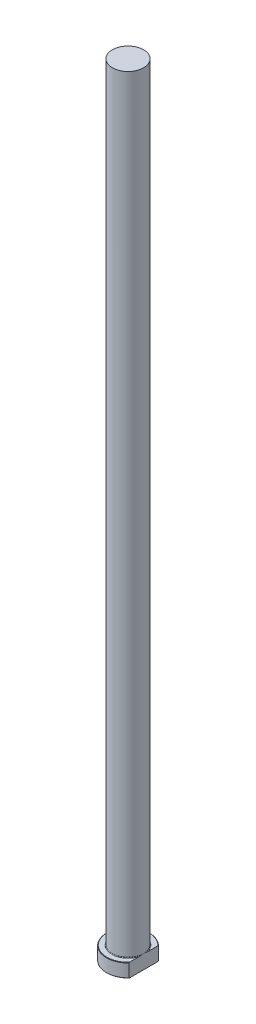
ISO-10303-21;
HEADER;
FILE_DESCRIPTION(('STEP AP214'),'2;1');
FILE_NAME('part.step','',(''),(''),'','','');
FILE_SCHEMA(('AUTOMOTIVE_DESIGN { 1 0 10303 214 1 1 1 1 }'));
ENDSEC;
DATA;
#1=APPLICATION_CONTEXT('core data for automotive mechanical design processes');
#2=APPLICATION_PROTOCOL_DEFINITION('international standard','automotive_design',2000,#1);
#3=PRODUCT_CONTEXT('',#1,'mechanical');
#4=PRODUCT('Part','Part','',(#3));
#5=PRODUCT_RELATED_PRODUCT_CATEGORY('part','',(#4));
#6=PRODUCT_DEFINITION_FORMATION('','',#4);
#7=PRODUCT_DEFINITION_CONTEXT('part definition',#1,'design');
#8=PRODUCT_DEFINITION('design','',#6,#7);
#9=PRODUCT_DEFINITION_SHAPE('','',#8);
#10=(LENGTH_UNIT() NAMED_UNIT(*) SI_UNIT(.MILLI.,.METRE.));
#11=(NAMED_UNIT(*) PLANE_ANGLE_UNIT() SI_UNIT($,.RADIAN.));
#12=(NAMED_UNIT(*) SI_UNIT($,.STERADIAN.) SOLID_ANGLE_UNIT());
#13=UNCERTAINTY_MEASURE_WITH_UNIT(LENGTH_MEASURE(1.E-05),#10,'distance_accuracy_value','');
#14=(GEOMETRIC_REPRESENTATION_CONTEXT(3) GLOBAL_UNCERTAINTY_ASSIGNED_CONTEXT((#13)) GLOBAL_UNIT_ASSIGNED_CONTEXT((#10,
#11,#12)) REPRESENTATION_CONTEXT('',''));
#15=CARTESIAN_POINT('',(0.,0.,0.));
#16=DIRECTION('',(0.,0.,1.));
#17=DIRECTION('',(1.,0.,0.));
#18=AXIS2_PLACEMENT_3D('',#15,#16,#17);
#19=CARTESIAN_POINT('',(0.,0.,0.));
#20=DIRECTION('',(0.,-1.,0.));
#21=DIRECTION('',(0.,0.,-1.));
#22=AXIS2_PLACEMENT_3D('',#19,#20,#21);
#23=PLANE('',#22);
#24=CARTESIAN_POINT('',(0.,0.,0.));
#25=DIRECTION('',(0.,-1.,0.));
#26=DIRECTION('',(0.,0.,-1.));
#27=AXIS2_PLACEMENT_3D('',#24,#25,#26);
#28=CIRCLE('',#27,10.7999999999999);
#29=CARTESIAN_POINT('',(7.99999999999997,0.,7.25534285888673));
#30=VERTEX_POINT('',#29);
#31=CARTESIAN_POINT('',(7.99999999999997,0.,-7.25534285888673));
#32=VERTEX_POINT('',#31);
#33=EDGE_CURVE('E98',#30,#32,#28,.T.);
#34=ORIENTED_EDGE('',*,*,#33,.T.);
#35=DIRECTION('',(0.,0.,1.));
#36=VECTOR('',#35,1.);
#37=CARTESIAN_POINT('',(7.99999999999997,0.,-7.54983443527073));
#38=LINE('',#37,#36);
#39=EDGE_CURVE('E83',#32,#30,#38,.T.);
#40=ORIENTED_EDGE('',*,*,#39,.T.);
#41=EDGE_LOOP('',(#34,#40));
#42=FACE_BOUND('',#41,.T.);
#43=ADVANCED_FACE('F32',(#42),#23,.T.);
#44=CARTESIAN_POINT('',(0.,259.958771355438,0.));
#45=DIRECTION('',(0.,1.,0.));
#46=DIRECTION('',(0.,0.,1.));
#47=AXIS2_PLACEMENT_3D('',#44,#45,#46);
#48=CYLINDRICAL_SURFACE('',#47,11.);
#49=CARTESIAN_POINT('',(0.,6.79999999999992,0.));
#50=DIRECTION('',(0.,1.,0.));
#51=DIRECTION('',(0.,0.,1.));
#52=AXIS2_PLACEMENT_3D('',#49,#50,#51);
#53=CIRCLE('',#52,11.);
#54=CARTESIAN_POINT('',(7.99999999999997,6.79999999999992,7.54983443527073));
#55=VERTEX_POINT('',#54);
#56=CARTESIAN_POINT('',(7.99999999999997,6.79999999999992,-7.54983443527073));
#57=VERTEX_POINT('',#56);
#58=EDGE_CURVE('E104',#55,#57,#53,.F.);
#59=ORIENTED_EDGE('',*,*,#58,.T.);
#60=DIRECTION('',(0.,-1.,0.));
#61=VECTOR('',#60,1.);
#62=CARTESIAN_POINT('',(7.99999999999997,400.,-7.54983443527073));
#63=LINE('',#62,#61);
#64=CARTESIAN_POINT('',(7.99999999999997,0.200000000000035,-7.54983443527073));
#65=VERTEX_POINT('',#64);
#66=EDGE_CURVE('E183',#57,#65,#63,.T.);
#67=ORIENTED_EDGE('',*,*,#66,.T.);
#68=CARTESIAN_POINT('',(0.,0.200000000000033,0.));
#69=DIRECTION('',(0.,-1.,0.));
#70=DIRECTION('',(0.,0.,-1.));
#71=AXIS2_PLACEMENT_3D('',#68,#69,#70);
#72=CIRCLE('',#71,11.);
#73=CARTESIAN_POINT('',(7.99999999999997,0.200000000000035,7.54983443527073));
#74=VERTEX_POINT('',#73);
#75=EDGE_CURVE('E100',#65,#74,#72,.F.);
#76=ORIENTED_EDGE('',*,*,#75,.T.);
#77=DIRECTION('',(0.,-1.,0.));
#78=VECTOR('',#77,1.);
#79=CARTESIAN_POINT('',(7.99999999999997,400.,7.54983443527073));
#80=LINE('',#79,#78);
#81=EDGE_CURVE('E93',#55,#74,#80,.T.);
#82=ORIENTED_EDGE('',*,*,#81,.F.);
#83=EDGE_LOOP('',(#59,#67,#76,#82));
#84=FACE_BOUND('',#83,.T.);
#85=ADVANCED_FACE('F158',(#84),#48,.T.);
#86=CARTESIAN_POINT('',(-11.,7.,0.));
#87=DIRECTION('',(0.,1.,0.));
#88=DIRECTION('',(0.,0.,1.));
#89=AXIS2_PLACEMENT_3D('',#86,#87,#88);
#90=PLANE('',#89);
#91=CARTESIAN_POINT('',(0.,7.,0.));
#92=DIRECTION('',(0.,1.,0.));
#93=DIRECTION('',(0.,0.,1.));
#94=AXIS2_PLACEMENT_3D('',#91,#92,#93);
#95=CIRCLE('',#94,10.7999999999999);
#96=CARTESIAN_POINT('',(7.99999999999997,7.,-7.25534285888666));
#97=VERTEX_POINT('',#96);
#98=CARTESIAN_POINT('',(7.99999999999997,7.,7.25534285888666));
#99=VERTEX_POINT('',#98);
#100=EDGE_CURVE('E178',#97,#99,#95,.T.);
#101=ORIENTED_EDGE('',*,*,#100,.T.);
#102=DIRECTION('',(0.,0.,-1.));
#103=VECTOR('',#102,1.);
#104=CARTESIAN_POINT('',(7.99999999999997,7.,0.));
#105=LINE('',#104,#103);
#106=CARTESIAN_POINT('',(7.99999999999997,6.99999999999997,2.21133443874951));
#107=VERTEX_POINT('',#106);
#108=EDGE_CURVE('E57',#99,#107,#105,.T.);
#109=ORIENTED_EDGE('',*,*,#108,.T.);
#110=CARTESIAN_POINT('',(0.,7.,0.));
#111=DIRECTION('',(0.,1.,0.));
#112=DIRECTION('',(0.,0.,1.));
#113=AXIS2_PLACEMENT_3D('',#110,#111,#112);
#114=CIRCLE('',#113,8.29999999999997);
#115=CARTESIAN_POINT('',(7.99999999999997,6.99999999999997,-2.21133443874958));
#116=VERTEX_POINT('',#115);
#117=EDGE_CURVE('E107',#107,#116,#114,.F.);
#118=ORIENTED_EDGE('',*,*,#117,.T.);
#119=EDGE_CURVE('E136',#116,#97,#105,.T.);
#120=ORIENTED_EDGE('',*,*,#119,.T.);
#121=EDGE_LOOP('',(#101,#109,#118,#120));
#122=FACE_BOUND('',#121,.T.);
#123=ADVANCED_FACE('F147',(#122),#90,.T.);
#124=CARTESIAN_POINT('',(0.,7.00000000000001,0.));
#125=DIRECTION('',(0.,-1.,0.));
#126=DIRECTION('',(0.,0.,-1.));
#127=AXIS2_PLACEMENT_3D('',#124,#125,#126);
#128=CONICAL_SURFACE('',#127,10.7999999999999,0.785398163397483);
#129=ORIENTED_EDGE('',*,*,#58,.F.);
#130=CARTESIAN_POINT('',(7.99999999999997,-0.63673082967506,16.6106304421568));
#131=CARTESIAN_POINT('',(7.99999999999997,-0.418611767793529,16.3685283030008));
#132=CARTESIAN_POINT('',(7.99999999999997,-0.200984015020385,16.125984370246));
#133=CARTESIAN_POINT('',(7.99999999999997,0.233148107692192,15.6398927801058));
#134=CARTESIAN_POINT('',(7.99999999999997,0.449652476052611,15.3963451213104));
#135=CARTESIAN_POINT('',(7.99999999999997,1.09739989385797,14.6638687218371));
#136=CARTESIAN_POINT('',(7.99999999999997,1.52674426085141,14.1732538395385));
#137=CARTESIAN_POINT('',(7.99999999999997,2.16792810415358,13.4304656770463));
#138=CARTESIAN_POINT('',(7.99999999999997,2.38226067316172,13.1804430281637));
#139=CARTESIAN_POINT('',(7.99999999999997,2.80892954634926,12.6787083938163));
#140=CARTESIAN_POINT('',(7.99999999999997,3.02126589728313,12.4269964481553));
#141=CARTESIAN_POINT('',(7.99999999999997,3.44357020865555,11.9216744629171));
#142=CARTESIAN_POINT('',(7.99999999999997,3.65353861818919,11.6680647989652));
#143=CARTESIAN_POINT('',(7.99999999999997,4.07074862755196,11.1585723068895));
#144=CARTESIAN_POINT('',(7.99999999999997,4.27798998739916,10.9026892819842));
#145=CARTESIAN_POINT('',(7.99999999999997,4.66965190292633,10.412760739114));
#146=CARTESIAN_POINT('',(7.99999999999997,4.85436868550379,10.1789522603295));
#147=CARTESIAN_POINT('',(7.99999999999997,5.220635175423,9.70886883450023));
#148=CARTESIAN_POINT('',(7.99999999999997,5.40218492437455,9.47259391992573));
#149=CARTESIAN_POINT('',(7.99999999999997,5.76149237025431,8.99721569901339));
#150=CARTESIAN_POINT('',(7.99999999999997,5.93925050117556,8.75811272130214));
#151=CARTESIAN_POINT('',(7.99999999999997,6.29022306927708,8.27660199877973));
#152=CARTESIAN_POINT('',(7.99999999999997,6.4634376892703,8.03419438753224));
#153=CARTESIAN_POINT('',(7.99999999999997,6.80398487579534,7.5460499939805));
#154=CARTESIAN_POINT('',(7.99999999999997,6.97132935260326,7.30032154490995));
#155=CARTESIAN_POINT('',(7.99999999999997,7.29928849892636,6.80437777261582));
#156=CARTESIAN_POINT('',(7.99999999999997,7.45990280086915,6.55416220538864));
#157=CARTESIAN_POINT('',(7.99999999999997,7.77264940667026,6.04873149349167));
#158=CARTESIAN_POINT('',(7.99999999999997,7.92478824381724,5.79352041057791));
#159=CARTESIAN_POINT('',(7.99999999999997,8.21859570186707,5.27715744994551));
#160=CARTESIAN_POINT('',(7.99999999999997,8.3602661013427,5.01600659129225));
#161=CARTESIAN_POINT('',(7.99999999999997,8.62213596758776,4.50319242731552));
#162=CARTESIAN_POINT('',(7.99999999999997,8.74311989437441,4.25193242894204));
#163=CARTESIAN_POINT('',(7.99999999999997,8.97065709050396,3.74287674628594));
#164=CARTESIAN_POINT('',(7.99999999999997,9.07720941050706,3.48508063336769));
#165=CARTESIAN_POINT('',(7.99999999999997,9.27220860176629,2.96337495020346));
#166=CARTESIAN_POINT('',(7.99999999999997,9.36069936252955,2.69948197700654));
#167=CARTESIAN_POINT('',(7.99999999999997,9.51604316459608,2.16542713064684));
#168=CARTESIAN_POINT('',(7.99999999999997,9.58290677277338,1.89526838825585));
#169=CARTESIAN_POINT('',(7.99999999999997,9.68291221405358,1.39216000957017));
#170=CARTESIAN_POINT('',(7.99999999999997,9.7196747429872,1.15993430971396));
#171=CARTESIAN_POINT('',(7.99999999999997,9.77336730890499,0.693196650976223));
#172=CARTESIAN_POINT('',(7.99999999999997,9.7903003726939,0.458685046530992));
#173=CARTESIAN_POINT('',(7.99999999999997,9.80342851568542,-0.010672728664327));
#174=CARTESIAN_POINT('',(7.99999999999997,9.79964609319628,-0.245518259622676));
#175=CARTESIAN_POINT('',(7.99999999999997,9.77160926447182,-0.71398933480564));
#176=CARTESIAN_POINT('',(7.99999999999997,9.74735189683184,-0.947614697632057));
#177=CARTESIAN_POINT('',(7.99999999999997,9.67070830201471,-1.47287443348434));
#178=CARTESIAN_POINT('',(7.99999999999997,9.61261890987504,-1.7636763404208));
#179=CARTESIAN_POINT('',(7.99999999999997,9.469821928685,-2.33873282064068));
#180=CARTESIAN_POINT('',(7.99999999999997,9.38509750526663,-2.62298313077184));
#181=CARTESIAN_POINT('',(7.99999999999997,9.24134311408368,-3.0443685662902));
#182=CARTESIAN_POINT('',(7.99999999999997,9.19048552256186,-3.18437323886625));
#183=CARTESIAN_POINT('',(7.99999999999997,9.08381674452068,-3.4624156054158));
#184=CARTESIAN_POINT('',(7.99999999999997,9.0280078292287,-3.60045416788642));
#185=CARTESIAN_POINT('',(7.99999999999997,8.91195481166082,-3.8746324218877));
#186=CARTESIAN_POINT('',(7.99999999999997,8.8517110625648,-4.01077226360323));
#187=CARTESIAN_POINT('',(7.99999999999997,8.72725899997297,-4.28124317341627));
#188=CARTESIAN_POINT('',(7.99999999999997,8.66305017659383,-4.41557400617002));
#189=CARTESIAN_POINT('',(7.99999999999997,8.48984738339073,-4.76597692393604));
#190=CARTESIAN_POINT('',(7.99999999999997,8.37796178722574,-4.98062176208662));
#191=CARTESIAN_POINT('',(7.99999999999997,8.14649205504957,-5.40573762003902));
#192=CARTESIAN_POINT('',(7.99999999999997,8.0269065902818,-5.61620791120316));
#193=CARTESIAN_POINT('',(7.99999999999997,7.78128707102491,-6.03349586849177));
#194=CARTESIAN_POINT('',(7.99999999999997,7.65524949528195,-6.24031145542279));
#195=CARTESIAN_POINT('',(7.99999999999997,7.39783636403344,-6.65060320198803));
#196=CARTESIAN_POINT('',(7.99999999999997,7.266460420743,-6.85407911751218));
#197=CARTESIAN_POINT('',(7.99999999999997,6.9989035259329,-7.25856399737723));
#198=CARTESIAN_POINT('',(7.99999999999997,6.86271149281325,-7.45956561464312));
#199=CARTESIAN_POINT('',(7.99999999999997,6.58651908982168,-7.85893907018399));
#200=CARTESIAN_POINT('',(7.99999999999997,6.44651858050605,-8.057310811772));
#201=CARTESIAN_POINT('',(7.99999999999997,6.02178241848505,-8.64881247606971));
#202=CARTESIAN_POINT('',(7.99999999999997,5.73221467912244,-9.03847436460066));
#203=CARTESIAN_POINT('',(7.99999999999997,5.14234581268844,-9.81218500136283));
#204=CARTESIAN_POINT('',(7.99999999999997,4.84200393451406,-10.1962024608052));
#205=CARTESIAN_POINT('',(7.99999999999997,4.2340481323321,-10.9584616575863));
#206=CARTESIAN_POINT('',(7.99999999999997,3.926433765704,-11.3367030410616));
#207=CARTESIAN_POINT('',(7.99999999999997,3.30600745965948,-12.0880358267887));
#208=CARTESIAN_POINT('',(7.99999999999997,2.99320302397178,-12.461133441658));
#209=CARTESIAN_POINT('',(7.99999999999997,2.36317801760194,-13.2035599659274));
#210=CARTESIAN_POINT('',(7.99999999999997,2.04595754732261,-13.5728889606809));
#211=CARTESIAN_POINT('',(7.99999999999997,1.3364401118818,-14.3909378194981));
#212=CARTESIAN_POINT('',(7.99999999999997,0.943258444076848,-14.8388897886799));
#213=CARTESIAN_POINT('',(7.99999999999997,0.351483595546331,-15.5068127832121));
#214=CARTESIAN_POINT('',(7.99999999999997,0.154449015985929,-15.7281687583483));
#215=CARTESIAN_POINT('',(7.99999999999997,-0.240498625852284,-16.1700151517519));
#216=CARTESIAN_POINT('',(7.99999999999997,-0.438411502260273,-16.3905057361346));
#217=CARTESIAN_POINT('',(7.99999999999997,-0.636730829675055,-16.6106304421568));
#218=B_SPLINE_CURVE_WITH_KNOTS('',3,(#130,#131,#132,#133,#134,#135,#136,#137,#138,#139,#140,
#141,#142,#143,#144,#145,#146,#147,#148,#149,#150,#151,#152,#153,#154,#155,#156,#157,#158,#159,
#160,#161,#162,#163,#164,#165,#166,#167,#168,#169,#170,#171,#172,#173,#174,#175,#176,#177,#178,
#179,#180,#181,#182,#183,#184,#185,#186,#187,#188,#189,#190,#191,#192,#193,#194,#195,#196,#197,
#198,#199,#200,#201,#202,#203,#204,#205,#206,#207,#208,#209,#210,#211,#212,#213,#214,#215,#216,
#217),.UNSPECIFIED.,.F.,.F.,(4,2,2,2,2,2,2,2,2,2,2,2,2,2,2,2,2,2,2,2,2,2,2,2,2,2,2,2,2,2,2,2,2,
2,2,2,2,2,2,2,2,2,2,4),(0.,0.977598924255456,1.95519922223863,3.91099512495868,4.89893858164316,
5.88685884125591,6.87458847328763,7.8624044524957,8.75629469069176,9.65017317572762,
10.5439487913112,11.4376883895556,12.3294952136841,13.2213506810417,14.1125088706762,
15.0035153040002,15.8397621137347,16.6760639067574,17.510308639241,18.3441451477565,
19.0487229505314,19.7531931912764,20.4568984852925,21.1607055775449,22.0488428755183,
22.937542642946,23.3843335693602,23.8309205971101,24.2774720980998,24.7240811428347,
25.4500411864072,26.176126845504,26.9026130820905,27.6291521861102,28.3574884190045,
29.0858513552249,30.5420520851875,32.004505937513,33.4670490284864,34.9276355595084,
36.3881889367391,38.1762452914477,39.0652821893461,39.9541391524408),.UNSPECIFIED.);
#219=EDGE_CURVE('E135',#55,#99,#218,.T.);
#220=ORIENTED_EDGE('',*,*,#219,.T.);
#221=ORIENTED_EDGE('',*,*,#100,.F.);
#222=EDGE_CURVE('E127',#97,#57,#218,.T.);
#223=ORIENTED_EDGE('',*,*,#222,.T.);
#224=EDGE_LOOP('',(#129,#220,#221,#223));
#225=FACE_BOUND('',#224,.T.);
#226=ADVANCED_FACE('F143',(#225),#128,.T.);
#227=CARTESIAN_POINT('',(0.,0.200000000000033,0.));
#228=DIRECTION('',(0.,1.,0.));
#229=DIRECTION('',(0.,0.,1.));
#230=AXIS2_PLACEMENT_3D('',#227,#228,#229);
#231=CONICAL_SURFACE('',#230,11.,0.785398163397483);
#232=ORIENTED_EDGE('',*,*,#75,.F.);
#233=CARTESIAN_POINT('',(7.99999999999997,7.63673082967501,-16.6106304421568));
#234=CARTESIAN_POINT('',(7.99999999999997,7.41861176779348,-16.3685283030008));
#235=CARTESIAN_POINT('',(7.99999999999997,7.20098401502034,-16.125984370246));
#236=CARTESIAN_POINT('',(7.99999999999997,6.76685189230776,-15.6398927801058));
#237=CARTESIAN_POINT('',(7.99999999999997,6.55034752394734,-15.3963451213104));
#238=CARTESIAN_POINT('',(7.99999999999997,5.90260010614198,-14.6638687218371));
#239=CARTESIAN_POINT('',(7.99999999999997,5.47325573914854,-14.1732538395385));
#240=CARTESIAN_POINT('',(7.99999999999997,4.83207189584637,-13.4304656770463));
#241=CARTESIAN_POINT('',(7.99999999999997,4.61773932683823,-13.1804430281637));
#242=CARTESIAN_POINT('',(7.99999999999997,4.19107045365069,-12.6787083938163));
#243=CARTESIAN_POINT('',(7.99999999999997,3.97873410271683,-12.4269964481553));
#244=CARTESIAN_POINT('',(7.99999999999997,3.55642979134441,-11.9216744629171));
#245=CARTESIAN_POINT('',(7.99999999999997,3.34646138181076,-11.6680647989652));
#246=CARTESIAN_POINT('',(7.99999999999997,2.92925137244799,-11.1585723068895));
#247=CARTESIAN_POINT('',(7.99999999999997,2.72201001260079,-10.9026892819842));
#248=CARTESIAN_POINT('',(7.99999999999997,2.33034809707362,-10.412760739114));
#249=CARTESIAN_POINT('',(7.99999999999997,2.14563131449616,-10.1789522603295));
#250=CARTESIAN_POINT('',(7.99999999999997,1.77936482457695,-9.70886883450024));
#251=CARTESIAN_POINT('',(7.99999999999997,1.5978150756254,-9.47259391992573));
#252=CARTESIAN_POINT('',(7.99999999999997,1.23850762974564,-8.99721569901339));
#253=CARTESIAN_POINT('',(7.99999999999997,1.06074949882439,-8.75811272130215));
#254=CARTESIAN_POINT('',(7.99999999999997,0.709776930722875,-8.27660199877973));
#255=CARTESIAN_POINT('',(7.99999999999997,0.53656231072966,-8.03419438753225));
#256=CARTESIAN_POINT('',(7.99999999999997,0.196015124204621,-7.5460499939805));
#257=CARTESIAN_POINT('',(7.99999999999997,0.0286706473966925,-7.30032154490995));
#258=CARTESIAN_POINT('',(7.99999999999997,-0.299288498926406,-6.80437777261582));
#259=CARTESIAN_POINT('',(7.99999999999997,-0.459902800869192,-6.55416220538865));
#260=CARTESIAN_POINT('',(7.99999999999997,-0.772649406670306,-6.04873149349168));
#261=CARTESIAN_POINT('',(7.99999999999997,-0.924788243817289,-5.79352041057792));
#262=CARTESIAN_POINT('',(7.99999999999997,-1.21859570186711,-5.27715744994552));
#263=CARTESIAN_POINT('',(7.99999999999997,-1.36026610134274,-5.01600659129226));
#264=CARTESIAN_POINT('',(7.99999999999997,-1.6221359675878,-4.50319242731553));
#265=CARTESIAN_POINT('',(7.99999999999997,-1.74311989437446,-4.25193242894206));
#266=CARTESIAN_POINT('',(7.99999999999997,-1.97065709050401,-3.74287674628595));
#267=CARTESIAN_POINT('',(7.99999999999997,-2.0772094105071,-3.4850806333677));
#268=CARTESIAN_POINT('',(7.99999999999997,-2.27220860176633,-2.96337495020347));
#269=CARTESIAN_POINT('',(7.99999999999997,-2.36069936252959,-2.69948197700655));
#270=CARTESIAN_POINT('',(7.99999999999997,-2.51604316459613,-2.16542713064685));
#271=CARTESIAN_POINT('',(7.99999999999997,-2.58290677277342,-1.89526838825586));
#272=CARTESIAN_POINT('',(7.99999999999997,-2.68291221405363,-1.39216000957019));
#273=CARTESIAN_POINT('',(7.99999999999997,-2.71967474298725,-1.15993430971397));
#274=CARTESIAN_POINT('',(7.99999999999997,-2.77336730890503,-0.693196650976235));
#275=CARTESIAN_POINT('',(7.99999999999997,-2.79030037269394,-0.458685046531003));
#276=CARTESIAN_POINT('',(7.99999999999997,-2.80342851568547,0.0106727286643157));
#277=CARTESIAN_POINT('',(7.99999999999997,-2.79964609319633,0.245518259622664));
#278=CARTESIAN_POINT('',(7.99999999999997,-2.77160926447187,0.713989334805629));
#279=CARTESIAN_POINT('',(7.99999999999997,-2.74735189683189,0.947614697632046));
#280=CARTESIAN_POINT('',(7.99999999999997,-2.67070830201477,1.47287443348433));
#281=CARTESIAN_POINT('',(7.99999999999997,-2.61261890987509,1.76367634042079));
#282=CARTESIAN_POINT('',(7.99999999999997,-2.46982192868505,2.33873282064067));
#283=CARTESIAN_POINT('',(7.99999999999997,-2.38509750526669,2.62298313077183));
#284=CARTESIAN_POINT('',(7.99999999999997,-2.24134311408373,3.04436856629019));
#285=CARTESIAN_POINT('',(7.99999999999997,-2.19048552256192,3.18437323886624));
#286=CARTESIAN_POINT('',(7.99999999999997,-2.08381674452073,3.46241560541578));
#287=CARTESIAN_POINT('',(7.99999999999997,-2.02800782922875,3.6004541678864));
#288=CARTESIAN_POINT('',(7.99999999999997,-1.91195481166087,3.87463242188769));
#289=CARTESIAN_POINT('',(7.99999999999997,-1.85171106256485,4.01077226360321));
#290=CARTESIAN_POINT('',(7.99999999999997,-1.72725899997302,4.28124317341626));
#291=CARTESIAN_POINT('',(7.99999999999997,-1.66305017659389,4.41557400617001));
#292=CARTESIAN_POINT('',(7.99999999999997,-1.48984738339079,4.76597692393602));
#293=CARTESIAN_POINT('',(7.99999999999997,-1.37796178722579,4.9806217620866));
#294=CARTESIAN_POINT('',(7.99999999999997,-1.14649205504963,5.405737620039));
#295=CARTESIAN_POINT('',(7.99999999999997,-1.02690659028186,5.61620791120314));
#296=CARTESIAN_POINT('',(7.99999999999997,-0.781287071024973,6.03349586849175));
#297=CARTESIAN_POINT('',(7.99999999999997,-0.65524949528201,6.24031145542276));
#298=CARTESIAN_POINT('',(7.99999999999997,-0.397836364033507,6.65060320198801));
#299=CARTESIAN_POINT('',(7.99999999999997,-0.266460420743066,6.85407911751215));
#300=CARTESIAN_POINT('',(7.99999999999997,0.00109647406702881,7.2585639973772));
#301=CARTESIAN_POINT('',(7.99999999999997,0.137288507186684,7.45956561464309));
#302=CARTESIAN_POINT('',(7.99999999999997,0.413480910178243,7.85893907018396));
#303=CARTESIAN_POINT('',(7.99999999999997,0.553481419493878,8.05731081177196));
#304=CARTESIAN_POINT('',(7.99999999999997,0.978217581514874,8.64881247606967));
#305=CARTESIAN_POINT('',(7.99999999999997,1.26778532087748,9.03847436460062));
#306=CARTESIAN_POINT('',(7.99999999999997,1.85765418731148,9.81218500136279));
#307=CARTESIAN_POINT('',(7.99999999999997,2.15799606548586,10.1962024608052));
#308=CARTESIAN_POINT('',(7.99999999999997,2.76595186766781,10.9584616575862));
#309=CARTESIAN_POINT('',(7.99999999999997,3.07356623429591,11.3367030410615));
#310=CARTESIAN_POINT('',(7.99999999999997,3.69399254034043,12.0880358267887));
#311=CARTESIAN_POINT('',(7.99999999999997,4.00679697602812,12.461133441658));
#312=CARTESIAN_POINT('',(7.99999999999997,4.63682198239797,13.2035599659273));
#313=CARTESIAN_POINT('',(7.99999999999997,4.95404245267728,13.5728889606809));
#314=CARTESIAN_POINT('',(7.99999999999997,5.66355988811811,14.390937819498));
#315=CARTESIAN_POINT('',(7.99999999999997,6.05674155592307,14.8388897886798));
#316=CARTESIAN_POINT('',(7.99999999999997,6.6485164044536,15.5068127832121));
#317=CARTESIAN_POINT('',(7.99999999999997,6.845550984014,15.7281687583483));
#318=CARTESIAN_POINT('',(7.99999999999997,7.24049862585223,16.1700151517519));
#319=CARTESIAN_POINT('',(7.99999999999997,7.43841150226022,16.3905057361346));
#320=CARTESIAN_POINT('',(7.99999999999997,7.63673082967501,16.6106304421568));
#321=B_SPLINE_CURVE_WITH_KNOTS('',3,(#233,#234,#235,#236,#237,#238,#239,#240,#241,#242,#243,
#244,#245,#246,#247,#248,#249,#250,#251,#252,#253,#254,#255,#256,#257,#258,#259,#260,#261,#262,
#263,#264,#265,#266,#267,#268,#269,#270,#271,#272,#273,#274,#275,#276,#277,#278,#279,#280,#281,
#282,#283,#284,#285,#286,#287,#288,#289,#290,#291,#292,#293,#294,#295,#296,#297,#298,#299,#300,
#301,#302,#303,#304,#305,#306,#307,#308,#309,#310,#311,#312,#313,#314,#315,#316,#317,#318,#319,
#320),.UNSPECIFIED.,.F.,.F.,(4,2,2,2,2,2,2,2,2,2,2,2,2,2,2,2,2,2,2,2,2,2,2,2,2,2,2,2,2,2,2,2,2,
2,2,2,2,2,2,2,2,2,2,4),(0.,0.977598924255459,1.95519922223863,3.91099512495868,4.89893858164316,
5.88685884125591,6.87458847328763,7.8624044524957,8.75629469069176,9.65017317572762,
10.5439487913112,11.4376883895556,12.3294952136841,13.2213506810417,14.1125088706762,
15.0035153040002,15.8397621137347,16.6760639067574,17.510308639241,18.3441451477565,
19.0487229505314,19.7531931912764,20.4568984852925,21.1607055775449,22.0488428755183,
22.937542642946,23.3843335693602,23.83092059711,24.2774720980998,24.7240811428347,
25.4500411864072,26.176126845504,26.9026130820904,27.6291521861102,28.3574884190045,
29.0858513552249,30.5420520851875,32.0045059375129,33.4670490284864,34.9276355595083,
36.388188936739,38.1762452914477,39.0652821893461,39.9541391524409),.UNSPECIFIED.);
#322=EDGE_CURVE('E86',#65,#32,#321,.T.);
#323=ORIENTED_EDGE('',*,*,#322,.T.);
#324=ORIENTED_EDGE('',*,*,#33,.F.);
#325=EDGE_CURVE('E89',#30,#74,#321,.T.);
#326=ORIENTED_EDGE('',*,*,#325,.T.);
#327=EDGE_LOOP('',(#232,#323,#324,#326));
#328=FACE_BOUND('',#327,.T.);
#329=ADVANCED_FACE('F97',(#328),#231,.T.);
#330=CARTESIAN_POINT('',(0.,7.29999999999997,0.));
#331=DIRECTION('',(0.,1.,0.));
#332=DIRECTION('',(0.,0.,1.));
#333=AXIS2_PLACEMENT_3D('',#330,#331,#332);
#334=TOROIDAL_SURFACE('',#333,8.29999999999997,0.3);
#335=CARTESIAN_POINT('',(7.99999999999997,7.29999999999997,0.));
#336=CARTESIAN_POINT('',(7.99999999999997,7.30000062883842,1.41343368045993E-10));
#337=CARTESIAN_POINT('',(7.99999999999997,7.30000125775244,-3.45355322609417E-07));
#338=CARTESIAN_POINT('',(7.99999999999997,7.30000241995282,-1.23398463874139E-06));
#339=CARTESIAN_POINT('',(7.99999999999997,7.30000291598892,-1.80141989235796E-06));
#340=CARTESIAN_POINT('',(7.99999999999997,7.30000399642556,-3.18390842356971E-06));
#341=CARTESIAN_POINT('',(7.99999999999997,7.30000456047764,-4.02115832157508E-06));
#342=CARTESIAN_POINT('',(7.99999999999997,7.30000552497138,-5.71072460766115E-06));
#343=CARTESIAN_POINT('',(7.99999999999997,7.30000593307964,-6.55926444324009E-06));
#344=CARTESIAN_POINT('',(7.99999999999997,7.30000755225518,-1.000964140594E-05));
#345=CARTESIAN_POINT('',(7.99999999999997,7.30000869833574,-1.26477244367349E-05));
#346=CARTESIAN_POINT('',(7.99999999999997,7.30001047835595,-1.77422280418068E-05));
#347=CARTESIAN_POINT('',(7.99999999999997,7.30001115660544,-2.01836505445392E-05));
#348=CARTESIAN_POINT('',(7.99999999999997,7.30001417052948,-3.09435594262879E-05));
#349=CARTESIAN_POINT('',(7.99999999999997,7.30001656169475,-3.92473415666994E-05));
#350=CARTESIAN_POINT('',(7.99999999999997,7.30001991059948,-5.46311733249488E-05));
#351=CARTESIAN_POINT('',(7.99999999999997,7.30002104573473,-6.16717033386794E-05));
#352=CARTESIAN_POINT('',(7.99999999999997,7.30002955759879,-0.000115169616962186));
#353=CARTESIAN_POINT('',(7.99999999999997,7.30003630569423,-0.000161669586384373));
#354=CARTESIAN_POINT('',(7.99999999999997,7.30006581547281,-0.00034712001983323));
#355=CARTESIAN_POINT('',(7.99999999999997,7.30009364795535,-0.000485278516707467));
#356=CARTESIAN_POINT('',(7.99999999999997,7.30020325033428,-0.00103711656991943));
#357=CARTESIAN_POINT('',(7.99999999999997,7.30028197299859,-0.00145117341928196));
#358=CARTESIAN_POINT('',(7.99999999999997,7.30059973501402,-0.00311182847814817));
#359=CARTESIAN_POINT('',(7.99999999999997,7.30084275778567,-0.00435790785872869));
#360=CARTESIAN_POINT('',(7.99999999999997,7.30186073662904,-0.00958966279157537));
#361=CARTESIAN_POINT('',(7.99999999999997,7.30263061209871,-0.0135760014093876));
#362=CARTESIAN_POINT('',(7.99999999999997,7.30870312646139,-0.0450030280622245));
#363=CARTESIAN_POINT('',(7.99999999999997,7.31402334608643,-0.0724414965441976));
#364=CARTESIAN_POINT('',(7.99999999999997,7.32442239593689,-0.126197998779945));
#365=CARTESIAN_POINT('',(7.99999999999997,7.32950218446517,-0.152515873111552));
#366=CARTESIAN_POINT('',(7.99999999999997,7.34609783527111,-0.23868034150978));
#367=CARTESIAN_POINT('',(7.99999999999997,7.35757011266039,-0.29853557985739));
#368=CARTESIAN_POINT('',(7.99999999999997,7.37688511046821,-0.400403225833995));
#369=CARTESIAN_POINT('',(7.99999999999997,7.38478827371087,-0.442404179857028));
#370=CARTESIAN_POINT('',(7.99999999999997,7.40022249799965,-0.525284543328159));
#371=CARTESIAN_POINT('',(7.99999999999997,7.40775782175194,-0.566163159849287));
#372=CARTESIAN_POINT('',(7.99999999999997,7.4322438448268,-0.700743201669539));
#373=CARTESIAN_POINT('',(7.99999999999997,7.44879297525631,-0.794518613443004));
#374=CARTESIAN_POINT('',(7.99999999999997,7.48053424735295,-0.983225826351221));
#375=CARTESIAN_POINT('',(7.99999999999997,7.49571186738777,-1.07816009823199));
#376=CARTESIAN_POINT('',(7.99999999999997,7.52532008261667,-1.27781321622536));
#377=CARTESIAN_POINT('',(7.99999999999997,7.53952614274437,-1.38256589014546));
#378=CARTESIAN_POINT('',(7.99999999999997,7.564310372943,-1.59223320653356));
#379=CARTESIAN_POINT('',(7.99999999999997,7.57489817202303,-1.6971466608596));
#380=CARTESIAN_POINT('',(7.99999999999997,7.58780012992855,-1.86417161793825));
#381=CARTESIAN_POINT('',(7.99999999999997,7.59172630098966,-1.92615747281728));
#382=CARTESIAN_POINT('',(7.99999999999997,7.59748111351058,-2.05022364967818));
#383=CARTESIAN_POINT('',(7.99999999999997,7.59931001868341,-2.11230395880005));
#384=CARTESIAN_POINT('',(7.99999999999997,7.60036180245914,-2.23528941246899));
#385=CARTESIAN_POINT('',(7.99999999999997,7.59963462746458,-2.29619395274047));
#386=CARTESIAN_POINT('',(7.99999999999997,7.59500883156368,-2.41785147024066));
#387=CARTESIAN_POINT('',(7.99999999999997,7.59111224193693,-2.47860451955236));
#388=CARTESIAN_POINT('',(7.99999999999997,7.57906933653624,-2.60042626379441));
#389=CARTESIAN_POINT('',(7.99999999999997,7.570876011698,-2.66149089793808));
#390=CARTESIAN_POINT('',(7.99999999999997,7.55390997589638,-2.7523359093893));
#391=CARTESIAN_POINT('',(7.99999999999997,7.54745990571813,-2.78254437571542));
#392=CARTESIAN_POINT('',(7.99999999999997,7.5325641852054,-2.84244543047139));
#393=CARTESIAN_POINT('',(7.99999999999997,7.52412026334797,-2.87213844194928));
#394=CARTESIAN_POINT('',(7.99999999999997,7.50454333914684,-2.93081083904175));
#395=CARTESIAN_POINT('',(7.99999999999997,7.4933995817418,-2.95978684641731));
#396=CARTESIAN_POINT('',(7.99999999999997,7.47379430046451,-3.00191342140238));
#397=CARTESIAN_POINT('',(7.99999999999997,7.46677809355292,-3.01573193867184));
#398=CARTESIAN_POINT('',(7.99999999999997,7.45153430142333,-3.04267574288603));
#399=CARTESIAN_POINT('',(7.99999999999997,7.44330842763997,-3.05580197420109));
#400=CARTESIAN_POINT('',(7.99999999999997,7.42520334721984,-3.0811225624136));
#401=CARTESIAN_POINT('',(7.99999999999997,7.41530529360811,-3.09330368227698));
#402=CARTESIAN_POINT('',(7.99999999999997,7.39348961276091,-3.11567039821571));
#403=CARTESIAN_POINT('',(7.99999999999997,7.38158911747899,-3.12587146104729));
#404=CARTESIAN_POINT('',(7.99999999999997,7.3626809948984,-3.13802739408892));
#405=CARTESIAN_POINT('',(7.99999999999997,7.35660667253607,-3.14142291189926));
#406=CARTESIAN_POINT('',(7.99999999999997,7.34401523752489,-3.14727797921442));
#407=CARTESIAN_POINT('',(7.99999999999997,7.33749832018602,-3.14973793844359));
#408=CARTESIAN_POINT('',(7.99999999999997,7.32406766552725,-3.15352036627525));
#409=CARTESIAN_POINT('',(7.99999999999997,7.31715078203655,-3.15483196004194));
#410=CARTESIAN_POINT('',(7.99999999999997,7.30319454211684,-3.15612126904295));
#411=CARTESIAN_POINT('',(7.99999999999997,7.29615528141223,-3.15609998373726));
#412=CARTESIAN_POINT('',(7.99999999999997,7.28287791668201,-3.15479583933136));
#413=CARTESIAN_POINT('',(7.99999999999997,7.27662738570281,-3.15363338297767));
#414=CARTESIAN_POINT('',(7.99999999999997,7.26438977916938,-3.15033645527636));
#415=CARTESIAN_POINT('',(7.99999999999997,7.25840290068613,-3.14820126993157));
#416=CARTESIAN_POINT('',(7.99999999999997,7.24428488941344,-3.14202752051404));
#417=CARTESIAN_POINT('',(7.99999999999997,7.2363403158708,-3.13756526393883));
#418=CARTESIAN_POINT('',(7.99999999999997,7.22124755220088,-3.1274544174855));
#419=CARTESIAN_POINT('',(7.99999999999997,7.21410153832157,-3.12180270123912));
#420=CARTESIAN_POINT('',(7.99999999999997,7.19559955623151,-3.10524942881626));
#421=CARTESIAN_POINT('',(7.99999999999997,7.18498382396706,-3.09352989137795));
#422=CARTESIAN_POINT('',(7.99999999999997,7.16550497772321,-3.068745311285));
#423=CARTESIAN_POINT('',(7.99999999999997,7.15664572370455,-3.05567739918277));
#424=CARTESIAN_POINT('',(7.99999999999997,7.13735489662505,-3.02391619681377));
#425=CARTESIAN_POINT('',(7.99999999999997,7.12749252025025,-3.00488123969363));
#426=CARTESIAN_POINT('',(7.99999999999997,7.10958189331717,-2.96596235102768));
#427=CARTESIAN_POINT('',(7.99999999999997,7.10153733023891,-2.9460767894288));
#428=CARTESIAN_POINT('',(7.99999999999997,7.08679055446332,-2.90559744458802));
#429=CARTESIAN_POINT('',(7.99999999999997,7.08010240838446,-2.88499860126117));
#430=CARTESIAN_POINT('',(7.99999999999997,7.06789000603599,-2.84348873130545));
#431=CARTESIAN_POINT('',(7.99999999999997,7.06236453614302,-2.8225780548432));
#432=CARTESIAN_POINT('',(7.99999999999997,7.04913807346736,-2.76752236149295));
#433=CARTESIAN_POINT('',(7.99999999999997,7.04220598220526,-2.73319311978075));
#434=CARTESIAN_POINT('',(7.99999999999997,7.0302605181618,-2.66419726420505));
#435=CARTESIAN_POINT('',(7.99999999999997,7.02524820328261,-2.62953047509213));
#436=CARTESIAN_POINT('',(7.99999999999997,7.0124950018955,-2.52504816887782));
#437=CARTESIAN_POINT('',(7.99999999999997,7.00708017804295,-2.45494936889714));
#438=CARTESIAN_POINT('',(7.99999999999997,7.000733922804,-2.31725135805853));
#439=CARTESIAN_POINT('',(7.99999999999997,6.99964073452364,-2.24965783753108));
#440=CARTESIAN_POINT('',(7.99999999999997,7.00055672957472,-2.11488194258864));
#441=CARTESIAN_POINT('',(7.99999999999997,7.00254831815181,-2.04769941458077));
#442=CARTESIAN_POINT('',(7.99999999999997,7.00911662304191,-1.91019632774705));
#443=CARTESIAN_POINT('',(7.99999999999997,7.01381425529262,-1.83988191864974));
#444=CARTESIAN_POINT('',(7.99999999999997,7.02534418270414,-1.69947139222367));
#445=CARTESIAN_POINT('',(7.99999999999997,7.0321753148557,-1.62937517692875));
#446=CARTESIAN_POINT('',(7.99999999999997,7.04774659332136,-1.48770318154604));
#447=CARTESIAN_POINT('',(7.99999999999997,7.05652844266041,-1.41613205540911));
#448=CARTESIAN_POINT('',(7.99999999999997,7.0755719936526,-1.2729917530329));
#449=CARTESIAN_POINT('',(7.99999999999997,7.08583764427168,-1.20142310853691));
#450=CARTESIAN_POINT('',(7.99999999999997,7.11167035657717,-1.03117663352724));
#451=CARTESIAN_POINT('',(7.99999999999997,7.12776522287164,-0.932579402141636));
#452=CARTESIAN_POINT('',(7.99999999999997,7.16130143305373,-0.736797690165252));
#453=CARTESIAN_POINT('',(7.99999999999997,7.1787249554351,-0.639610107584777));
#454=CARTESIAN_POINT('',(7.99999999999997,7.21241690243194,-0.456833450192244));
#455=CARTESIAN_POINT('',(7.99999999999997,7.22858010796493,-0.37122483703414));
#456=CARTESIAN_POINT('',(7.99999999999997,7.25353789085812,-0.240583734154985));
#457=CARTESIAN_POINT('',(7.99999999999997,7.26219901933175,-0.195525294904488));
#458=CARTESIAN_POINT('',(7.99999999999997,7.27945035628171,-0.106166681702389));
#459=CARTESIAN_POINT('',(7.99999999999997,7.28803936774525,-0.0618662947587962));
#460=CARTESIAN_POINT('',(7.99999999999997,7.29737150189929,-0.0135646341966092));
#461=CARTESIAN_POINT('',(7.99999999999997,7.29814363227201,-0.0095669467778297));
#462=CARTESIAN_POINT('',(7.99999999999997,7.29916212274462,-0.0043326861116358));
#463=CARTESIAN_POINT('',(7.99999999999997,7.29940341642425,-0.003095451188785));
#464=CARTESIAN_POINT('',(7.99999999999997,7.29971907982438,-0.00144576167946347));
#465=CARTESIAN_POINT('',(7.99999999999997,7.29979739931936,-0.00103382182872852));
#466=CARTESIAN_POINT('',(7.99999999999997,7.29990652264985,-0.000484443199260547));
#467=CARTESIAN_POINT('',(7.99999999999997,7.29993429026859,-0.000346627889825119));
#468=CARTESIAN_POINT('',(7.99999999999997,7.2999637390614,-0.000161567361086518));
#469=CARTESIAN_POINT('',(7.99999999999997,7.29997047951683,-0.000115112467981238));
#470=CARTESIAN_POINT('',(7.99999999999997,7.29997897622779,-6.16610384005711E-05));
#471=CARTESIAN_POINT('',(7.99999999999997,7.29998010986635,-5.46227082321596E-05));
#472=CARTESIAN_POINT('',(7.99999999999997,7.299983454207,-3.92436766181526E-05));
#473=CARTESIAN_POINT('',(7.99999999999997,7.2999858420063,-3.09423877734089E-05));
#474=CARTESIAN_POINT('',(7.99999999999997,7.29998885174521,-2.01851368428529E-05));
#475=CARTESIAN_POINT('',(7.99999999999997,7.29998952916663,-1.7743877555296E-05));
#476=CARTESIAN_POINT('',(7.99999999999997,7.29999130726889,-1.26495938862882E-05));
#477=CARTESIAN_POINT('',(7.99999999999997,7.29999245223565,-1.00115437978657E-05));
#478=CARTESIAN_POINT('',(7.99999999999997,7.29999406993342,-6.56108535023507E-06));
#479=CARTESIAN_POINT('',(7.99999999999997,7.29999447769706,-5.71247448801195E-06));
#480=CARTESIAN_POINT('',(7.99999999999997,7.29999544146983,-4.02270412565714E-06));
#481=CARTESIAN_POINT('',(7.99999999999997,7.2999960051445,-3.18531707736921E-06));
#482=CARTESIAN_POINT('',(7.99999999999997,7.29999708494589,-1.80252014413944E-06));
#483=CARTESIAN_POINT('',(7.99999999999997,7.29999758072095,-1.23492752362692E-06));
#484=CARTESIAN_POINT('',(7.99999999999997,7.29999874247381,-3.45879353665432E-07));
#485=CARTESIAN_POINT('',(7.99999999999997,7.29999937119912,-1.41334918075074E-10));
#486=CARTESIAN_POINT('',(7.99999999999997,7.29999999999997,0.));
#487=B_SPLINE_CURVE_WITH_KNOTS('',3,(#335,#336,#337,#338,#339,#340,#341,#342,#343,#344,#345,
#346,#347,#348,#349,#350,#351,#352,#353,#354,#355,#356,#357,#358,#359,#360,#361,#362,#363,#364,
#365,#366,#367,#368,#369,#370,#371,#372,#373,#374,#375,#376,#377,#378,#379,#380,#381,#382,#383,
#384,#385,#386,#387,#388,#389,#390,#391,#392,#393,#394,#395,#396,#397,#398,#399,#400,#401,#402,
#403,#404,#405,#406,#407,#408,#409,#410,#411,#412,#413,#414,#415,#416,#417,#418,#419,#420,#421,
#422,#423,#424,#425,#426,#427,#428,#429,#430,#431,#432,#433,#434,#435,#436,#437,#438,#439,#440,
#441,#442,#443,#444,#445,#446,#447,#448,#449,#450,#451,#452,#453,#454,#455,#456,#457,#458,#459,
#460,#461,#462,#463,#464,#465,#466,#467,#468,#469,#470,#471,#472,#473,#474,#475,#476,#477,#478,
#479,#480,#481,#482,#483,#484,#485,#486),.UNSPECIFIED.,.T.,.F.,(4,2,2,2,2,2,2,2,2,2,2,2,2,2,2,2,
2,2,2,2,2,2,2,2,2,2,2,2,2,2,2,2,2,2,2,2,2,2,2,2,2,2,2,2,2,2,2,2,2,2,2,2,2,2,2,2,2,2,2,2,2,2,2,2,
2,2,2,2,2,2,2,2,2,2,2,4),(0.,1.9430465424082E-06,4.23378863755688E-06,7.23541659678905E-06,
1.00606572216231E-05,1.86645549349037E-05,2.62590397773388E-05,5.21541728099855E-05,
7.352737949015E-05,0.000214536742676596,0.000637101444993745,0.00190178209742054,
0.00571013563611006,0.0178905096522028,0.101737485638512,0.182148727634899,0.364982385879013,
0.493196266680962,0.617898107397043,0.903563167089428,1.19196538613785,1.50905932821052,
1.82530271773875,2.01160528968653,2.19788443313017,2.38054404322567,2.56308667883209,
2.74766944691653,2.84028504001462,2.93282063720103,3.02573110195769,3.07218090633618,
3.11856561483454,3.1655130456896,3.21207753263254,3.23289308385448,3.25369950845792,
3.27470089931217,3.29568654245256,3.31467256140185,3.33367253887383,3.36085270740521,
3.38810522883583,3.43527567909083,3.48254866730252,3.54671214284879,3.61100462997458,
3.67593313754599,3.74079353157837,3.8457803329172,3.95082490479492,4.16152093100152,
4.36425153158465,4.56583006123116,4.77720385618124,4.98846262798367,5.20476776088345,
5.42165954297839,5.72134671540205,6.01755113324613,6.27891230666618,6.41656286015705,
6.55193629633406,6.56415137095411,6.56793269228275,6.5691909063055,6.56961242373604,
6.56975329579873,6.56977466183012,6.5698005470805,6.56980814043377,6.56981674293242,
6.56981956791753,6.56982256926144,6.56982485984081,6.56982680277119),.UNSPECIFIED.);
#488=CARTESIAN_POINT('',(7.99999999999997,7.29999999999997,0.));
#489=VERTEX_POINT('',#488);
#490=EDGE_CURVE('E11',#116,#489,#487,.T.);
#491=ORIENTED_EDGE('',*,*,#490,.F.);
#492=ORIENTED_EDGE('',*,*,#117,.F.);
#493=CARTESIAN_POINT('',(7.99999999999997,7.29999999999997,0.));
#494=CARTESIAN_POINT('',(7.99999999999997,7.29999937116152,-1.41343611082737E-10));
#495=CARTESIAN_POINT('',(7.99999999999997,7.29999874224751,3.45355322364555E-07));
#496=CARTESIAN_POINT('',(7.99999999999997,7.29999758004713,1.23398463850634E-06));
#497=CARTESIAN_POINT('',(7.99999999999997,7.29999708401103,1.80141989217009E-06));
#498=CARTESIAN_POINT('',(7.99999999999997,7.29999600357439,3.18390842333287E-06));
#499=CARTESIAN_POINT('',(7.99999999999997,7.29999543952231,4.0211583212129E-06));
#500=CARTESIAN_POINT('',(7.99999999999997,7.29999447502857,5.71072460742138E-06));
#501=CARTESIAN_POINT('',(7.99999999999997,7.2999940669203,6.55926444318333E-06));
#502=CARTESIAN_POINT('',(7.99999999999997,7.29999244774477,1.00096414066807E-05));
#503=CARTESIAN_POINT('',(7.99999999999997,7.2999913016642,1.26477244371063E-05));
#504=CARTESIAN_POINT('',(7.99999999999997,7.29998952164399,1.77422280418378E-05));
#505=CARTESIAN_POINT('',(7.99999999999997,7.2999888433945,2.01836505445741E-05));
#506=CARTESIAN_POINT('',(7.99999999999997,7.29998582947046,3.09435594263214E-05));
#507=CARTESIAN_POINT('',(7.99999999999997,7.29998343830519,3.92473415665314E-05));
#508=CARTESIAN_POINT('',(7.99999999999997,7.29998008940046,5.46311733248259E-05));
#509=CARTESIAN_POINT('',(7.99999999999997,7.29997895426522,6.16717033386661E-05));
#510=CARTESIAN_POINT('',(7.99999999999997,7.29997044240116,0.000115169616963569));
#511=CARTESIAN_POINT('',(7.99999999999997,7.29996369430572,0.000161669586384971));
#512=CARTESIAN_POINT('',(7.99999999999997,7.29993418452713,0.000347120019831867));
#513=CARTESIAN_POINT('',(7.99999999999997,7.2999063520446,0.000485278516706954));
#514=CARTESIAN_POINT('',(7.99999999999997,7.29979674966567,0.00103711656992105));
#515=CARTESIAN_POINT('',(7.99999999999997,7.29971802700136,0.00145117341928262));
#516=CARTESIAN_POINT('',(7.99999999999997,7.29940026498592,0.00311182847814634));
#517=CARTESIAN_POINT('',(7.99999999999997,7.29915724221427,0.00435790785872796));
#518=CARTESIAN_POINT('',(7.99999999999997,7.29813926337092,0.00958966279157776));
#519=CARTESIAN_POINT('',(7.99999999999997,7.29736938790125,0.0135760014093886));
#520=CARTESIAN_POINT('',(7.99999999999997,7.29129687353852,0.0450030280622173));
#521=CARTESIAN_POINT('',(7.99999999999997,7.28597665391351,0.0724414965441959));
#522=CARTESIAN_POINT('',(7.99999999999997,7.27557760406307,0.126197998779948));
#523=CARTESIAN_POINT('',(7.99999999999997,7.27049781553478,0.152515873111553));
#524=CARTESIAN_POINT('',(7.99999999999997,7.25390216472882,0.238680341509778));
#525=CARTESIAN_POINT('',(7.99999999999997,7.24242988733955,0.29853557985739));
#526=CARTESIAN_POINT('',(7.99999999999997,7.22311488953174,0.400403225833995));
#527=CARTESIAN_POINT('',(7.99999999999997,7.21521172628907,0.442404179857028));
#528=CARTESIAN_POINT('',(7.99999999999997,7.19977750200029,0.525284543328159));
#529=CARTESIAN_POINT('',(7.99999999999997,7.192242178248,0.566163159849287));
#530=CARTESIAN_POINT('',(7.99999999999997,7.16775615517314,0.700743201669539));
#531=CARTESIAN_POINT('',(7.99999999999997,7.15120702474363,0.794518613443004));
#532=CARTESIAN_POINT('',(7.99999999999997,7.119465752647,0.983225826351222));
#533=CARTESIAN_POINT('',(7.99999999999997,7.10428813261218,1.07816009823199));
#534=CARTESIAN_POINT('',(7.99999999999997,7.07467991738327,1.27781321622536));
#535=CARTESIAN_POINT('',(7.99999999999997,7.06047385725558,1.38256589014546));
#536=CARTESIAN_POINT('',(7.99999999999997,7.03568962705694,1.59223320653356));
#537=CARTESIAN_POINT('',(7.99999999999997,7.02510182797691,1.6971466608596));
#538=CARTESIAN_POINT('',(7.99999999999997,7.0121998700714,1.86417161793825));
#539=CARTESIAN_POINT('',(7.99999999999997,7.00827369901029,1.92615747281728));
#540=CARTESIAN_POINT('',(7.99999999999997,7.00251888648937,2.05022364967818));
#541=CARTESIAN_POINT('',(7.99999999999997,7.00068998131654,2.11230395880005));
#542=CARTESIAN_POINT('',(7.99999999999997,6.99963819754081,2.23528941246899));
#543=CARTESIAN_POINT('',(7.99999999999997,7.00036537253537,2.29619395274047));
#544=CARTESIAN_POINT('',(7.99999999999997,7.00499116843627,2.41785147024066));
#545=CARTESIAN_POINT('',(7.99999999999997,7.00888775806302,2.47860451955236));
#546=CARTESIAN_POINT('',(7.99999999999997,7.0209306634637,2.60042626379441));
#547=CARTESIAN_POINT('',(7.99999999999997,7.02912398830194,2.66149089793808));
#548=CARTESIAN_POINT('',(7.99999999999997,7.04609002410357,2.7523359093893));
#549=CARTESIAN_POINT('',(7.99999999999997,7.05254009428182,2.78254437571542));
#550=CARTESIAN_POINT('',(7.99999999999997,7.06743581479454,2.84244543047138));
#551=CARTESIAN_POINT('',(7.99999999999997,7.07587973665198,2.87213844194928));
#552=CARTESIAN_POINT('',(7.99999999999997,7.09545666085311,2.93081083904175));
#553=CARTESIAN_POINT('',(7.99999999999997,7.10660041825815,2.95978684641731));
#554=CARTESIAN_POINT('',(7.99999999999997,7.12620569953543,3.00191342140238));
#555=CARTESIAN_POINT('',(7.99999999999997,7.13322190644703,3.01573193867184));
#556=CARTESIAN_POINT('',(7.99999999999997,7.14846569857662,3.04267574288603));
#557=CARTESIAN_POINT('',(7.99999999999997,7.15669157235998,3.05580197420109));
#558=CARTESIAN_POINT('',(7.99999999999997,7.17479665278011,3.0811225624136));
#559=CARTESIAN_POINT('',(7.99999999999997,7.18469470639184,3.09330368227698));
#560=CARTESIAN_POINT('',(7.99999999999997,7.20651038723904,3.11567039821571));
#561=CARTESIAN_POINT('',(7.99999999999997,7.21841088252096,3.12587146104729));
#562=CARTESIAN_POINT('',(7.99999999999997,7.23731900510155,3.13802739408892));
#563=CARTESIAN_POINT('',(7.99999999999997,7.24339332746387,3.14142291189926));
#564=CARTESIAN_POINT('',(7.99999999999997,7.25598476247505,3.14727797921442));
#565=CARTESIAN_POINT('',(7.99999999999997,7.26250167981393,3.14973793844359));
#566=CARTESIAN_POINT('',(7.99999999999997,7.2759323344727,3.15352036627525));
#567=CARTESIAN_POINT('',(7.99999999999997,7.2828492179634,3.15483196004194));
#568=CARTESIAN_POINT('',(7.99999999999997,7.2968054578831,3.15612126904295));
#569=CARTESIAN_POINT('',(7.99999999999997,7.30384471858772,3.15609998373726));
#570=CARTESIAN_POINT('',(7.99999999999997,7.31712208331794,3.15479583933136));
#571=CARTESIAN_POINT('',(7.99999999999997,7.32337261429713,3.15363338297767));
#572=CARTESIAN_POINT('',(7.99999999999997,7.33561022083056,3.15033645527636));
#573=CARTESIAN_POINT('',(7.99999999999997,7.34159709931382,3.14820126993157));
#574=CARTESIAN_POINT('',(7.99999999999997,7.3557151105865,3.14202752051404));
#575=CARTESIAN_POINT('',(7.99999999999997,7.36365968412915,3.13756526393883));
#576=CARTESIAN_POINT('',(7.99999999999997,7.37875244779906,3.1274544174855));
#577=CARTESIAN_POINT('',(7.99999999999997,7.38589846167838,3.12180270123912));
#578=CARTESIAN_POINT('',(7.99999999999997,7.40440044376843,3.10524942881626));
#579=CARTESIAN_POINT('',(7.99999999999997,7.41501617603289,3.09352989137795));
#580=CARTESIAN_POINT('',(7.99999999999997,7.43449502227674,3.068745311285));
#581=CARTESIAN_POINT('',(7.99999999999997,7.4433542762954,3.05567739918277));
#582=CARTESIAN_POINT('',(7.99999999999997,7.4626451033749,3.02391619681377));
#583=CARTESIAN_POINT('',(7.99999999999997,7.47250747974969,3.00488123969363));
#584=CARTESIAN_POINT('',(7.99999999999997,7.49041810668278,2.96596235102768));
#585=CARTESIAN_POINT('',(7.99999999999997,7.49846266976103,2.9460767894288));
#586=CARTESIAN_POINT('',(7.99999999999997,7.51320944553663,2.90559744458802));
#587=CARTESIAN_POINT('',(7.99999999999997,7.51989759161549,2.88499860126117));
#588=CARTESIAN_POINT('',(7.99999999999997,7.53210999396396,2.84348873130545));
#589=CARTESIAN_POINT('',(7.99999999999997,7.53763546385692,2.8225780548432));
#590=CARTESIAN_POINT('',(7.99999999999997,7.55086192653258,2.76752236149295));
#591=CARTESIAN_POINT('',(7.99999999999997,7.55779401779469,2.73319311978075));
#592=CARTESIAN_POINT('',(7.99999999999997,7.56973948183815,2.66419726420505));
#593=CARTESIAN_POINT('',(7.99999999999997,7.57475179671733,2.62953047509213));
#594=CARTESIAN_POINT('',(7.99999999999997,7.58750499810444,2.52504816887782));
#595=CARTESIAN_POINT('',(7.99999999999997,7.592919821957,2.45494936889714));
#596=CARTESIAN_POINT('',(7.99999999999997,7.59926607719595,2.31725135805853));
#597=CARTESIAN_POINT('',(7.99999999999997,7.60035926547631,2.24965783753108));
#598=CARTESIAN_POINT('',(7.99999999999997,7.59944327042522,2.11488194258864));
#599=CARTESIAN_POINT('',(7.99999999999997,7.59745168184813,2.04769941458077));
#600=CARTESIAN_POINT('',(7.99999999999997,7.59088337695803,1.91019632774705));
#601=CARTESIAN_POINT('',(7.99999999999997,7.58618574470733,1.83988191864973));
#602=CARTESIAN_POINT('',(7.99999999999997,7.5746558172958,1.69947139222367));
#603=CARTESIAN_POINT('',(7.99999999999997,7.56782468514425,1.62937517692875));
#604=CARTESIAN_POINT('',(7.99999999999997,7.55225340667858,1.48770318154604));
#605=CARTESIAN_POINT('',(7.99999999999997,7.54347155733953,1.41613205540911));
#606=CARTESIAN_POINT('',(7.99999999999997,7.52442800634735,1.2729917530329));
#607=CARTESIAN_POINT('',(7.99999999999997,7.51416235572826,1.20142310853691));
#608=CARTESIAN_POINT('',(7.99999999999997,7.48832964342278,1.03117663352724));
#609=CARTESIAN_POINT('',(7.99999999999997,7.47223477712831,0.932579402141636));
#610=CARTESIAN_POINT('',(7.99999999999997,7.43869856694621,0.736797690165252));
#611=CARTESIAN_POINT('',(7.99999999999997,7.42127504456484,0.639610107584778));
#612=CARTESIAN_POINT('',(7.99999999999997,7.387583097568,0.456833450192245));
#613=CARTESIAN_POINT('',(7.99999999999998,7.37141989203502,0.371224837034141));
#614=CARTESIAN_POINT('',(7.99999999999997,7.34646210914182,0.240583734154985));
#615=CARTESIAN_POINT('',(7.99999999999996,7.3378009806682,0.195525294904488));
#616=CARTESIAN_POINT('',(7.99999999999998,7.32054964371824,0.106166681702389));
#617=CARTESIAN_POINT('',(8.00000000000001,7.3119606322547,0.0618662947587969));
#618=CARTESIAN_POINT('',(7.99999999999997,7.30262849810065,0.0135646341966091));
#619=CARTESIAN_POINT('',(7.99999999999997,7.30185636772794,0.00956694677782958));
#620=CARTESIAN_POINT('',(7.99999999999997,7.30083787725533,0.00433268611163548));
#621=CARTESIAN_POINT('',(7.99999999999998,7.3005965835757,0.00309545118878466));
#622=CARTESIAN_POINT('',(7.99999999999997,7.30028092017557,0.00144576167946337));
#623=CARTESIAN_POINT('',(7.99999999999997,7.30020260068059,0.00103382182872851));
#624=CARTESIAN_POINT('',(7.99999999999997,7.30009347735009,0.000484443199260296));
#625=CARTESIAN_POINT('',(7.99999999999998,7.30006570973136,0.000346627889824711));
#626=CARTESIAN_POINT('',(7.99999999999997,7.30003626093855,0.00016156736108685));
#627=CARTESIAN_POINT('',(7.99999999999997,7.30002952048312,0.000115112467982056));
#628=CARTESIAN_POINT('',(7.99999999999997,7.30002102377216,6.16610384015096E-05));
#629=CARTESIAN_POINT('',(7.99999999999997,7.30001989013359,5.46227082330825E-05));
#630=CARTESIAN_POINT('',(7.99999999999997,7.30001654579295,3.92436766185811E-05));
#631=CARTESIAN_POINT('',(7.99999999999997,7.30001415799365,3.09423877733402E-05));
#632=CARTESIAN_POINT('',(7.99999999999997,7.30001114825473,2.01851368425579E-05));
#633=CARTESIAN_POINT('',(7.99999999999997,7.30001047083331,1.77438775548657E-05));
#634=CARTESIAN_POINT('',(7.99999999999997,7.30000869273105,1.26495938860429E-05));
#635=CARTESIAN_POINT('',(7.99999999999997,7.3000075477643,1.00115437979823E-05));
#636=CARTESIAN_POINT('',(7.99999999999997,7.30000593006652,6.56108534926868E-06));
#637=CARTESIAN_POINT('',(7.99999999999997,7.30000552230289,5.71247448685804E-06));
#638=CARTESIAN_POINT('',(7.99999999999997,7.30000455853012,4.02270412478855E-06));
#639=CARTESIAN_POINT('',(7.99999999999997,7.30000399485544,3.18531707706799E-06));
#640=CARTESIAN_POINT('',(7.99999999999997,7.30000291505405,1.80252014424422E-06));
#641=CARTESIAN_POINT('',(7.99999999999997,7.30000241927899,1.23492752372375E-06));
#642=CARTESIAN_POINT('',(7.99999999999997,7.30000125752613,3.45879353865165E-07));
#643=CARTESIAN_POINT('',(7.99999999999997,7.30000062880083,1.41335160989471E-10));
#644=CARTESIAN_POINT('',(7.99999999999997,7.29999999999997,0.));
#645=B_SPLINE_CURVE_WITH_KNOTS('',3,(#493,#494,#495,#496,#497,#498,#499,#500,#501,#502,#503,
#504,#505,#506,#507,#508,#509,#510,#511,#512,#513,#514,#515,#516,#517,#518,#519,#520,#521,#522,
#523,#524,#525,#526,#527,#528,#529,#530,#531,#532,#533,#534,#535,#536,#537,#538,#539,#540,#541,
#542,#543,#544,#545,#546,#547,#548,#549,#550,#551,#552,#553,#554,#555,#556,#557,#558,#559,#560,
#561,#562,#563,#564,#565,#566,#567,#568,#569,#570,#571,#572,#573,#574,#575,#576,#577,#578,#579,
#580,#581,#582,#583,#584,#585,#586,#587,#588,#589,#590,#591,#592,#593,#594,#595,#596,#597,#598,
#599,#600,#601,#602,#603,#604,#605,#606,#607,#608,#609,#610,#611,#612,#613,#614,#615,#616,#617,
#618,#619,#620,#621,#622,#623,#624,#625,#626,#627,#628,#629,#630,#631,#632,#633,#634,#635,#636,
#637,#638,#639,#640,#641,#642,#643,#644),.UNSPECIFIED.,.T.,.F.,(4,2,2,2,2,2,2,2,2,2,2,2,2,2,2,2,
2,2,2,2,2,2,2,2,2,2,2,2,2,2,2,2,2,2,2,2,2,2,2,2,2,2,2,2,2,2,2,2,2,2,2,2,2,2,2,2,2,2,2,2,2,2,2,2,
2,2,2,2,2,2,2,2,2,2,2,4),(0.,1.94304654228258E-06,4.23378863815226E-06,7.23541659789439E-06,
1.00606572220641E-05,1.86645549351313E-05,2.62590397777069E-05,5.2154172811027E-05,
7.35273794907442E-05,0.000214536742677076,0.000637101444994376,0.00190178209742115,
0.00571013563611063,0.0178905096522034,0.101737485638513,0.1821487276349,0.364982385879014,
0.493196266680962,0.617898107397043,0.903563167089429,1.19196538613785,1.50905932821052,
1.82530271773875,2.01160528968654,2.19788443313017,2.38054404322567,2.56308667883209,
2.74766944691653,2.84028504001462,2.93282063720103,3.02573110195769,3.07218090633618,
3.11856561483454,3.1655130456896,3.21207753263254,3.23289308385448,3.25369950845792,
3.27470089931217,3.29568654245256,3.31467256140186,3.33367253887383,3.36085270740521,
3.38810522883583,3.43527567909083,3.48254866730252,3.54671214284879,3.61100462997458,
3.67593313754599,3.74079353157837,3.8457803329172,3.95082490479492,4.16152093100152,
4.36425153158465,4.56583006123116,4.77720385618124,4.98846262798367,5.20476776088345,
5.42165954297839,5.72134671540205,6.01755113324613,6.27891230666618,6.41656286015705,
6.55193629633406,6.56415137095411,6.56793269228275,6.5691909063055,6.56961242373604,
6.56975329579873,6.56977466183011,6.5698005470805,6.56980814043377,6.56981674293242,
6.56981956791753,6.56982256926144,6.56982485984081,6.56982680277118),.UNSPECIFIED.);
#646=EDGE_CURVE('E46',#489,#107,#645,.T.);
#647=ORIENTED_EDGE('',*,*,#646,.F.);
#648=CARTESIAN_POINT('',(0.,7.29999999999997,0.));
#649=DIRECTION('',(0.,1.,0.));
#650=DIRECTION('',(0.,0.,1.));
#651=AXIS2_PLACEMENT_3D('',#648,#649,#650);
#652=CIRCLE('',#651,7.99999999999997);
#653=EDGE_CURVE('E103',#489,#489,#652,.T.);
#654=ORIENTED_EDGE('',*,*,#653,.F.);
#655=EDGE_LOOP('',(#491,#492,#647,#654));
#656=FACE_BOUND('',#655,.T.);
#657=ADVANCED_FACE('F34',(#656),#334,.F.);
#658=CARTESIAN_POINT('',(0.,259.958771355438,0.));
#659=DIRECTION('',(0.,1.,0.));
#660=DIRECTION('',(0.,0.,1.));
#661=AXIS2_PLACEMENT_3D('',#658,#659,#660);
#662=CYLINDRICAL_SURFACE('',#661,7.99999999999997);
#663=ORIENTED_EDGE('',*,*,#653,.T.);
#664=EDGE_LOOP('',(#663));
#665=FACE_BOUND('',#664,.T.);
#666=CARTESIAN_POINT('',(0.,400.,0.));
#667=DIRECTION('',(0.,1.,0.));
#668=DIRECTION('',(0.,0.,1.));
#669=AXIS2_PLACEMENT_3D('',#666,#667,#668);
#670=CIRCLE('',#669,7.99999999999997);
#671=CARTESIAN_POINT('',(0.,400.,7.99999999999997));
#672=VERTEX_POINT('',#671);
#673=EDGE_CURVE('E101',#672,#672,#670,.T.);
#674=ORIENTED_EDGE('',*,*,#673,.F.);
#675=EDGE_LOOP('',(#674));
#676=FACE_BOUND('',#675,.T.);
#677=ADVANCED_FACE('F155',(#665,#676),#662,.T.);
#678=CARTESIAN_POINT('',(-7.99999999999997,400.,0.));
#679=DIRECTION('',(0.,1.,0.));
#680=DIRECTION('',(0.,0.,1.));
#681=AXIS2_PLACEMENT_3D('',#678,#679,#680);
#682=PLANE('',#681);
#683=ORIENTED_EDGE('',*,*,#673,.T.);
#684=EDGE_LOOP('',(#683));
#685=FACE_BOUND('',#684,.T.);
#686=ADVANCED_FACE('F121',(#685),#682,.T.);
#687=CARTESIAN_POINT('',(7.99999999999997,400.,-7.54983443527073));
#688=DIRECTION('',(1.,0.,0.));
#689=DIRECTION('',(0.,0.,-1.));
#690=AXIS2_PLACEMENT_3D('',#687,#688,#689);
#691=PLANE('',#690);
#692=ORIENTED_EDGE('',*,*,#66,.F.);
#693=ORIENTED_EDGE('',*,*,#222,.F.);
#694=ORIENTED_EDGE('',*,*,#119,.F.);
#695=ORIENTED_EDGE('',*,*,#490,.T.);
#696=ORIENTED_EDGE('',*,*,#646,.T.);
#697=ORIENTED_EDGE('',*,*,#108,.F.);
#698=ORIENTED_EDGE('',*,*,#219,.F.);
#699=ORIENTED_EDGE('',*,*,#81,.T.);
#700=ORIENTED_EDGE('',*,*,#325,.F.);
#701=ORIENTED_EDGE('',*,*,#39,.F.);
#702=ORIENTED_EDGE('',*,*,#322,.F.);
#703=EDGE_LOOP('',(#692,#693,#694,#695,#696,#697,#698,#699,#700,#701,#702));
#704=FACE_BOUND('',#703,.T.);
#705=ADVANCED_FACE('F85',(#704),#691,.T.);
#706=CLOSED_SHELL('',(#43,#85,#123,#226,#329,#657,#677,#686,#705));
#707=MANIFOLD_SOLID_BREP('B2',#706);
#708=ADVANCED_BREP_SHAPE_REPRESENTATION('',(#18,#707),#14);
#709=SHAPE_DEFINITION_REPRESENTATION(#9,#708);
ENDSEC;
END-ISO-10303-21;
